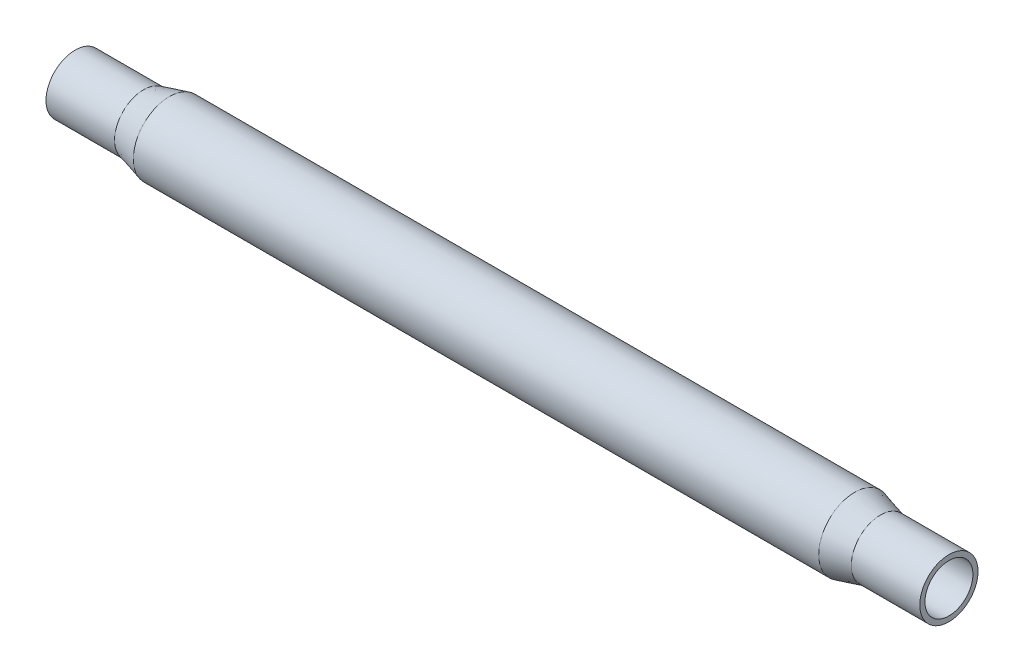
from build123d import *


with BuildPart() as part:
    # Esquisse1 → R_vol.-Mince1 (revolve)
    with BuildSketch(Plane.XY, mode=Mode.PRIVATE) as r_vol_mince1_sk:
        Polygon((-67.008472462, 17), (-27.008472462, 17), (-12.008472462, 21), (387.991527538, 21), (402.991527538, 17), (442.991527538, 17), (442.991527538, 14), (402.598396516, 14), (387.598396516, 18), (-11.61534144, 18), (-26.61534144, 14), (-67.008472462, 14), align=None)
    revolve(r_vol_mince1_sk.sketch.rotate(Axis((-91.895693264, 0, 0), (1, 0, 0)), 90), axis=Axis((-91.895693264, 0, 0), (1, 0, 0)))


solid = part.part
